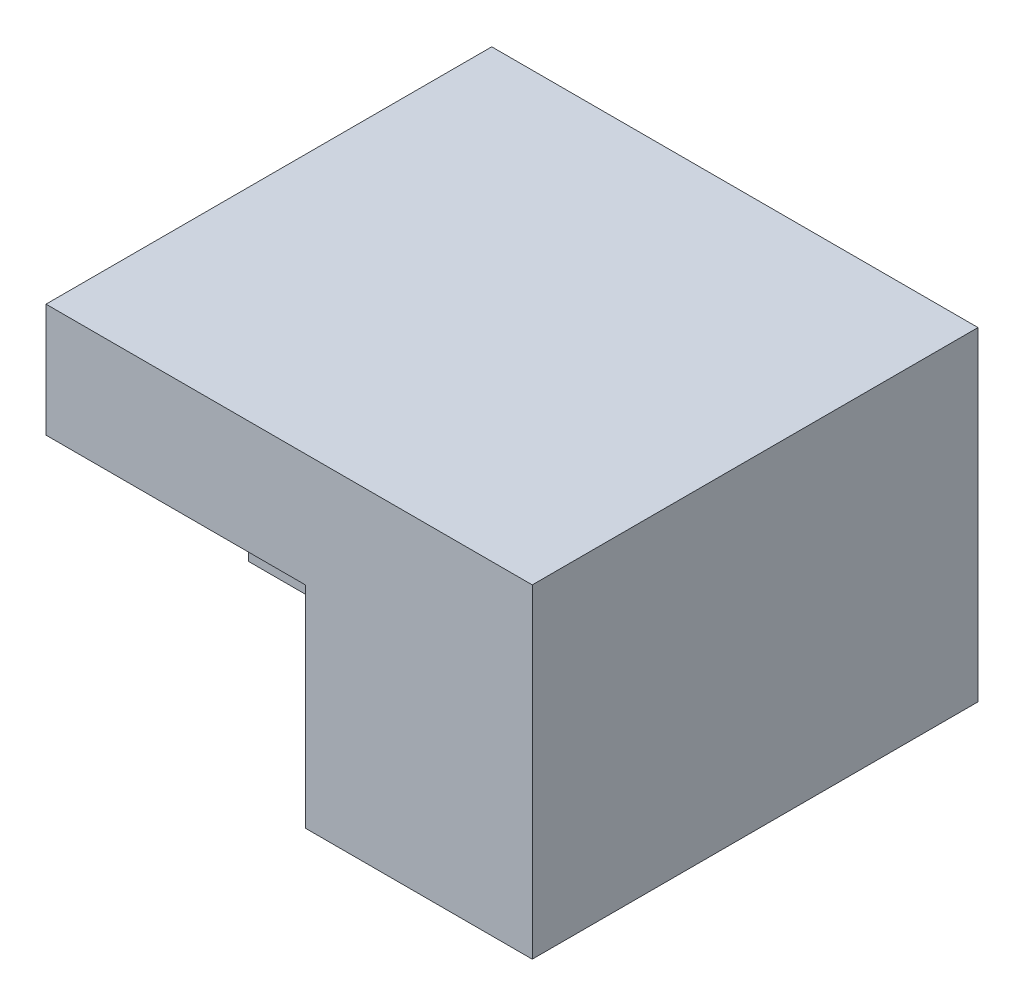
from build123d import *

# Parameters (mm, degrees)
SKETCH_1_W          = 60
SKETCH_1_H          = 40
EXTRUDE_1_DEPTH     = 55
SKETCH_2_W          = 32
SKETCH_2_H          = 26
CUT_EXTRUDE_1_DEPTH = 25


with BuildPart() as part:
    # Sketch 1 → Extrude 1 (new body)
    with BuildSketch(Plane.XY):
        with Locations((-30, 20)):
            Rectangle(SKETCH_1_W, SKETCH_1_H)
    extrude(amount=EXTRUDE_1_DEPTH)

    # Sketch 2 → Cut-Extrude 1 (cut)
    with BuildSketch(Plane.XY.offset(55)):
        with Locations((-44, 13)):
            Rectangle(SKETCH_2_W, SKETCH_2_H)
    extrude(amount=-CUT_EXTRUDE_1_DEPTH, mode=Mode.SUBTRACT)


solid = part.part
